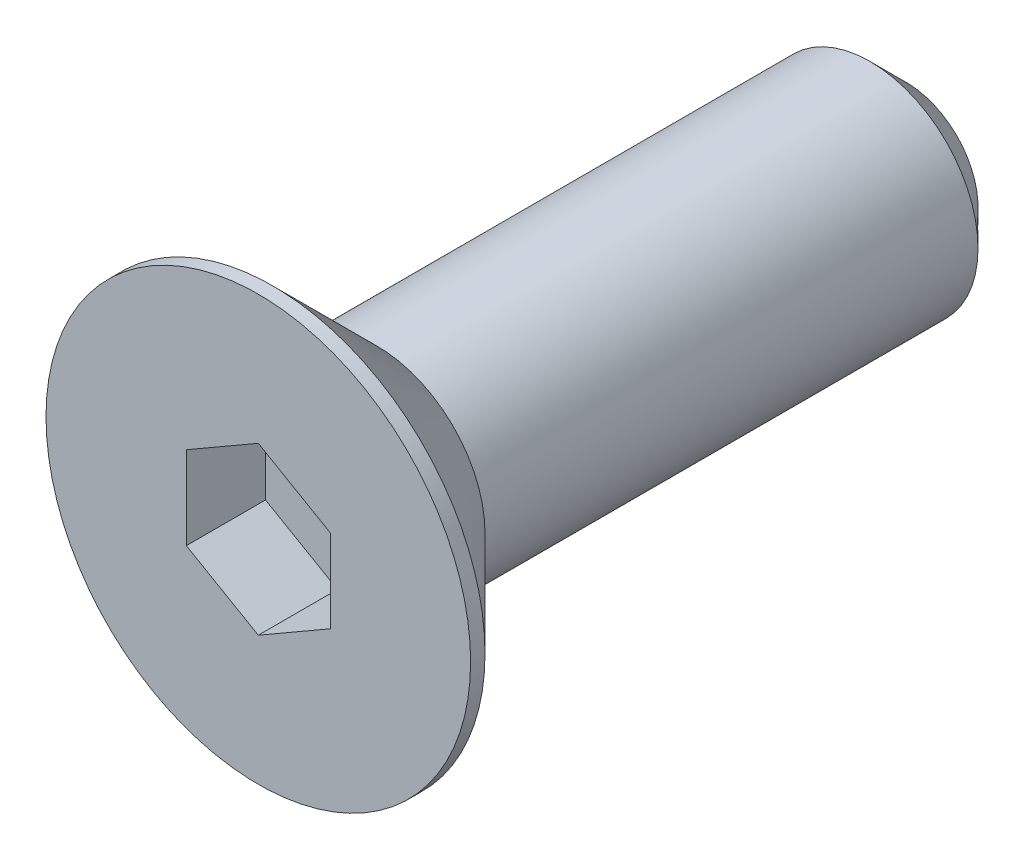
ISO-10303-21;
HEADER;
FILE_DESCRIPTION(('STEP AP214'),'2;1');
FILE_NAME('part.step','',(''),(''),'','','');
FILE_SCHEMA(('AUTOMOTIVE_DESIGN { 1 0 10303 214 1 1 1 1 }'));
ENDSEC;
DATA;
#1=APPLICATION_CONTEXT('core data for automotive mechanical design processes');
#2=APPLICATION_PROTOCOL_DEFINITION('international standard','automotive_design',2000,#1);
#3=PRODUCT_CONTEXT('',#1,'mechanical');
#4=PRODUCT('Part','Part','',(#3));
#5=PRODUCT_RELATED_PRODUCT_CATEGORY('part','',(#4));
#6=PRODUCT_DEFINITION_FORMATION('','',#4);
#7=PRODUCT_DEFINITION_CONTEXT('part definition',#1,'design');
#8=PRODUCT_DEFINITION('design','',#6,#7);
#9=PRODUCT_DEFINITION_SHAPE('','',#8);
#10=(LENGTH_UNIT() NAMED_UNIT(*) SI_UNIT(.MILLI.,.METRE.));
#11=(NAMED_UNIT(*) PLANE_ANGLE_UNIT() SI_UNIT($,.RADIAN.));
#12=(NAMED_UNIT(*) SI_UNIT($,.STERADIAN.) SOLID_ANGLE_UNIT());
#13=UNCERTAINTY_MEASURE_WITH_UNIT(LENGTH_MEASURE(1.E-05),#10,'distance_accuracy_value','');
#14=(GEOMETRIC_REPRESENTATION_CONTEXT(3) GLOBAL_UNCERTAINTY_ASSIGNED_CONTEXT((#13)) GLOBAL_UNIT_ASSIGNED_CONTEXT((#10,
#11,#12)) REPRESENTATION_CONTEXT('',''));
#15=CARTESIAN_POINT('',(0.,0.,0.));
#16=DIRECTION('',(0.,0.,1.));
#17=DIRECTION('',(1.,0.,0.));
#18=AXIS2_PLACEMENT_3D('',#15,#16,#17);
#19=CARTESIAN_POINT('',(0.,0.,0.));
#20=DIRECTION('',(0.,0.,1.));
#21=DIRECTION('',(1.,0.,0.));
#22=AXIS2_PLACEMENT_3D('',#19,#20,#21);
#23=PLANE('',#22);
#24=DIRECTION('',(-0.866025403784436,0.5,0.));
#25=VECTOR('',#24,1.);
#26=CARTESIAN_POINT('',(2.,1.15470053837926,0.));
#27=LINE('',#26,#25);
#28=CARTESIAN_POINT('',(2.,1.15470053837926,0.));
#29=VERTEX_POINT('',#28);
#30=CARTESIAN_POINT('',(0.,2.30940107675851,0.));
#31=VERTEX_POINT('',#30);
#32=EDGE_CURVE('E29',#29,#31,#27,.T.);
#33=ORIENTED_EDGE('',*,*,#32,.F.);
#34=DIRECTION('',(0.,1.,0.));
#35=VECTOR('',#34,1.);
#36=CARTESIAN_POINT('',(2.,-1.15470053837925,0.));
#37=LINE('',#36,#35);
#38=CARTESIAN_POINT('',(2.,-1.15470053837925,0.));
#39=VERTEX_POINT('',#38);
#40=EDGE_CURVE('E112',#39,#29,#37,.T.);
#41=ORIENTED_EDGE('',*,*,#40,.F.);
#42=DIRECTION('',(0.866025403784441,0.5,0.));
#43=VECTOR('',#42,1.);
#44=CARTESIAN_POINT('',(0.,-2.30940107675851,0.));
#45=LINE('',#44,#43);
#46=CARTESIAN_POINT('',(0.,-2.30940107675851,0.));
#47=VERTEX_POINT('',#46);
#48=EDGE_CURVE('E110',#47,#39,#45,.T.);
#49=ORIENTED_EDGE('',*,*,#48,.F.);
#50=DIRECTION('',(0.866025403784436,-0.5,0.));
#51=VECTOR('',#50,1.);
#52=CARTESIAN_POINT('',(-2.,-1.15470053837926,0.));
#53=LINE('',#52,#51);
#54=CARTESIAN_POINT('',(-2.,-1.15470053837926,0.));
#55=VERTEX_POINT('',#54);
#56=EDGE_CURVE('E77',#55,#47,#53,.T.);
#57=ORIENTED_EDGE('',*,*,#56,.F.);
#58=DIRECTION('',(0.,-1.,0.));
#59=VECTOR('',#58,1.);
#60=CARTESIAN_POINT('',(-2.,1.15470053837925,0.));
#61=LINE('',#60,#59);
#62=CARTESIAN_POINT('',(-2.,1.15470053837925,0.));
#63=VERTEX_POINT('',#62);
#64=EDGE_CURVE('E106',#63,#55,#61,.T.);
#65=ORIENTED_EDGE('',*,*,#64,.F.);
#66=DIRECTION('',(-0.866025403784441,-0.5,0.));
#67=VECTOR('',#66,1.);
#68=CARTESIAN_POINT('',(0.,2.30940107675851,0.));
#69=LINE('',#68,#67);
#70=EDGE_CURVE('E103',#31,#63,#69,.T.);
#71=ORIENTED_EDGE('',*,*,#70,.F.);
#72=EDGE_LOOP('',(#33,#41,#49,#57,#65,#71));
#73=FACE_BOUND('',#72,.T.);
#74=CARTESIAN_POINT('',(0.,0.,0.));
#75=DIRECTION('',(0.,0.,1.));
#76=DIRECTION('',(1.,0.,0.));
#77=AXIS2_PLACEMENT_3D('',#74,#75,#76);
#78=CIRCLE('',#77,5.9);
#79=CARTESIAN_POINT('',(5.9,0.,0.));
#80=VERTEX_POINT('',#79);
#81=EDGE_CURVE('E127',#80,#80,#78,.T.);
#82=ORIENTED_EDGE('',*,*,#81,.T.);
#83=EDGE_LOOP('',(#82));
#84=FACE_BOUND('',#83,.T.);
#85=ADVANCED_FACE('F14',(#73,#84),#23,.T.);
#86=CARTESIAN_POINT('',(0.,0.,0.));
#87=DIRECTION('',(0.,0.,1.));
#88=DIRECTION('',(1.,0.,0.));
#89=AXIS2_PLACEMENT_3D('',#86,#87,#88);
#90=CYLINDRICAL_SURFACE('',#89,5.9);
#91=CARTESIAN_POINT('',(0.,0.,-0.39999999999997));
#92=DIRECTION('',(0.,0.,1.));
#93=DIRECTION('',(1.,0.,0.));
#94=AXIS2_PLACEMENT_3D('',#91,#92,#93);
#95=CIRCLE('',#94,5.9);
#96=CARTESIAN_POINT('',(5.9,0.,-0.399999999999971));
#97=VERTEX_POINT('',#96);
#98=EDGE_CURVE('E124',#97,#97,#95,.T.);
#99=ORIENTED_EDGE('',*,*,#98,.T.);
#100=EDGE_LOOP('',(#99));
#101=FACE_BOUND('',#100,.T.);
#102=ORIENTED_EDGE('',*,*,#81,.F.);
#103=EDGE_LOOP('',(#102));
#104=FACE_BOUND('',#103,.T.);
#105=ADVANCED_FACE('F151',(#101,#104),#90,.T.);
#106=CARTESIAN_POINT('',(0.,0.,-0.39999999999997));
#107=DIRECTION('',(0.,0.,1.));
#108=DIRECTION('',(1.,0.,0.));
#109=AXIS2_PLACEMENT_3D('',#106,#107,#108);
#110=CONICAL_SURFACE('',#109,5.9,0.785398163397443);
#111=CARTESIAN_POINT('',(0.,0.,-3.3));
#112=DIRECTION('',(0.,0.,1.));
#113=DIRECTION('',(1.,0.,0.));
#114=AXIS2_PLACEMENT_3D('',#111,#112,#113);
#115=CIRCLE('',#114,3.);
#116=CARTESIAN_POINT('',(3.,0.,-3.3));
#117=VERTEX_POINT('',#116);
#118=EDGE_CURVE('E116',#117,#117,#115,.T.);
#119=ORIENTED_EDGE('',*,*,#118,.T.);
#120=EDGE_LOOP('',(#119));
#121=FACE_BOUND('',#120,.T.);
#122=ORIENTED_EDGE('',*,*,#98,.F.);
#123=EDGE_LOOP('',(#122));
#124=FACE_BOUND('',#123,.T.);
#125=ADVANCED_FACE('F157',(#121,#124),#110,.T.);
#126=CARTESIAN_POINT('',(0.,0.,0.));
#127=DIRECTION('',(0.,0.,1.));
#128=DIRECTION('',(1.,0.,0.));
#129=AXIS2_PLACEMENT_3D('',#126,#127,#128);
#130=CYLINDRICAL_SURFACE('',#129,3.);
#131=CARTESIAN_POINT('',(0.,0.,-17.));
#132=DIRECTION('',(0.,0.,-1.));
#133=DIRECTION('',(-1.,0.,0.));
#134=AXIS2_PLACEMENT_3D('',#131,#132,#133);
#135=CIRCLE('',#134,3.);
#136=CARTESIAN_POINT('',(-3.,0.,-17.));
#137=VERTEX_POINT('',#136);
#138=EDGE_CURVE('E22',#137,#137,#135,.F.);
#139=ORIENTED_EDGE('',*,*,#138,.T.);
#140=EDGE_LOOP('',(#139));
#141=FACE_BOUND('',#140,.T.);
#142=ORIENTED_EDGE('',*,*,#118,.F.);
#143=EDGE_LOOP('',(#142));
#144=FACE_BOUND('',#143,.T.);
#145=ADVANCED_FACE('F132',(#141,#144),#130,.T.);
#146=CARTESIAN_POINT('',(3.,0.,-18.));
#147=DIRECTION('',(0.,0.,-1.));
#148=DIRECTION('',(-1.,0.,0.));
#149=AXIS2_PLACEMENT_3D('',#146,#147,#148);
#150=PLANE('',#149);
#151=CARTESIAN_POINT('',(0.,0.,-18.));
#152=DIRECTION('',(0.,0.,-1.));
#153=DIRECTION('',(-1.,0.,0.));
#154=AXIS2_PLACEMENT_3D('',#151,#152,#153);
#155=CIRCLE('',#154,2.);
#156=CARTESIAN_POINT('',(-2.,0.,-18.));
#157=VERTEX_POINT('',#156);
#158=EDGE_CURVE('E9',#157,#157,#155,.T.);
#159=ORIENTED_EDGE('',*,*,#158,.T.);
#160=EDGE_LOOP('',(#159));
#161=FACE_BOUND('',#160,.T.);
#162=ADVANCED_FACE('F137',(#161),#150,.T.);
#163=CARTESIAN_POINT('',(0.,0.,-17.));
#164=DIRECTION('',(0.,0.,1.));
#165=DIRECTION('',(1.,0.,0.));
#166=AXIS2_PLACEMENT_3D('',#163,#164,#165);
#167=CONICAL_SURFACE('',#166,3.,0.785398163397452);
#168=ORIENTED_EDGE('',*,*,#158,.F.);
#169=EDGE_LOOP('',(#168));
#170=FACE_BOUND('',#169,.T.);
#171=ORIENTED_EDGE('',*,*,#138,.F.);
#172=EDGE_LOOP('',(#171));
#173=FACE_BOUND('',#172,.T.);
#174=ADVANCED_FACE('F16',(#170,#173),#167,.T.);
#175=CARTESIAN_POINT('',(2.,1.15470053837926,-2.2));
#176=DIRECTION('',(0.5,0.866025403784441,0.));
#177=DIRECTION('',(-0.866025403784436,0.5,0.));
#178=AXIS2_PLACEMENT_3D('',#175,#176,#177);
#179=PLANE('',#178);
#180=ORIENTED_EDGE('',*,*,#32,.T.);
#181=DIRECTION('',(0.,0.,1.));
#182=VECTOR('',#181,1.);
#183=CARTESIAN_POINT('',(0.,2.30940107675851,-2.2));
#184=LINE('',#183,#182);
#185=CARTESIAN_POINT('',(0.,2.30940107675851,-2.2));
#186=VERTEX_POINT('',#185);
#187=EDGE_CURVE('E59',#186,#31,#184,.T.);
#188=ORIENTED_EDGE('',*,*,#187,.F.);
#189=DIRECTION('',(-0.866025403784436,0.5,0.));
#190=VECTOR('',#189,1.);
#191=CARTESIAN_POINT('',(2.,1.15470053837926,-2.2));
#192=LINE('',#191,#190);
#193=CARTESIAN_POINT('',(2.,1.15470053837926,-2.2));
#194=VERTEX_POINT('',#193);
#195=EDGE_CURVE('E114',#194,#186,#192,.T.);
#196=ORIENTED_EDGE('',*,*,#195,.F.);
#197=DIRECTION('',(0.,0.,1.));
#198=VECTOR('',#197,1.);
#199=CARTESIAN_POINT('',(2.,1.15470053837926,-2.2));
#200=LINE('',#199,#198);
#201=EDGE_CURVE('E37',#194,#29,#200,.T.);
#202=ORIENTED_EDGE('',*,*,#201,.T.);
#203=EDGE_LOOP('',(#180,#188,#196,#202));
#204=FACE_BOUND('',#203,.T.);
#205=ADVANCED_FACE('F136',(#204),#179,.F.);
#206=CARTESIAN_POINT('',(2.,-1.15470053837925,-2.2));
#207=DIRECTION('',(1.,0.,0.));
#208=DIRECTION('',(0.,0.,-1.));
#209=AXIS2_PLACEMENT_3D('',#206,#207,#208);
#210=PLANE('',#209);
#211=ORIENTED_EDGE('',*,*,#40,.T.);
#212=ORIENTED_EDGE('',*,*,#201,.F.);
#213=DIRECTION('',(0.,1.,0.));
#214=VECTOR('',#213,1.);
#215=CARTESIAN_POINT('',(2.,-1.15470053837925,-2.2));
#216=LINE('',#215,#214);
#217=CARTESIAN_POINT('',(2.,-1.15470053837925,-2.2));
#218=VERTEX_POINT('',#217);
#219=EDGE_CURVE('E89',#218,#194,#216,.T.);
#220=ORIENTED_EDGE('',*,*,#219,.F.);
#221=DIRECTION('',(0.,0.,1.));
#222=VECTOR('',#221,1.);
#223=CARTESIAN_POINT('',(2.,-1.15470053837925,-2.2));
#224=LINE('',#223,#222);
#225=EDGE_CURVE('E81',#218,#39,#224,.T.);
#226=ORIENTED_EDGE('',*,*,#225,.T.);
#227=EDGE_LOOP('',(#211,#212,#220,#226));
#228=FACE_BOUND('',#227,.T.);
#229=ADVANCED_FACE('F145',(#228),#210,.F.);
#230=CARTESIAN_POINT('',(0.,-2.30940107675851,-2.2));
#231=DIRECTION('',(0.5,-0.866025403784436,0.));
#232=DIRECTION('',(0.866025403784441,0.5,0.));
#233=AXIS2_PLACEMENT_3D('',#230,#231,#232);
#234=PLANE('',#233);
#235=ORIENTED_EDGE('',*,*,#48,.T.);
#236=ORIENTED_EDGE('',*,*,#225,.F.);
#237=DIRECTION('',(0.866025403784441,0.5,0.));
#238=VECTOR('',#237,1.);
#239=CARTESIAN_POINT('',(0.,-2.30940107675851,-2.2));
#240=LINE('',#239,#238);
#241=CARTESIAN_POINT('',(0.,-2.30940107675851,-2.2));
#242=VERTEX_POINT('',#241);
#243=EDGE_CURVE('E85',#242,#218,#240,.T.);
#244=ORIENTED_EDGE('',*,*,#243,.F.);
#245=DIRECTION('',(0.,0.,1.));
#246=VECTOR('',#245,1.);
#247=CARTESIAN_POINT('',(0.,-2.30940107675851,-2.2));
#248=LINE('',#247,#246);
#249=EDGE_CURVE('E70',#242,#47,#248,.T.);
#250=ORIENTED_EDGE('',*,*,#249,.T.);
#251=EDGE_LOOP('',(#235,#236,#244,#250));
#252=FACE_BOUND('',#251,.T.);
#253=ADVANCED_FACE('F86',(#252),#234,.F.);
#254=CARTESIAN_POINT('',(-2.,-1.15470053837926,-2.2));
#255=DIRECTION('',(-0.5,-0.866025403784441,0.));
#256=DIRECTION('',(0.866025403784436,-0.5,0.));
#257=AXIS2_PLACEMENT_3D('',#254,#255,#256);
#258=PLANE('',#257);
#259=ORIENTED_EDGE('',*,*,#56,.T.);
#260=ORIENTED_EDGE('',*,*,#249,.F.);
#261=DIRECTION('',(0.866025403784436,-0.5,0.));
#262=VECTOR('',#261,1.);
#263=CARTESIAN_POINT('',(-2.,-1.15470053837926,-2.2));
#264=LINE('',#263,#262);
#265=CARTESIAN_POINT('',(-2.,-1.15470053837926,-2.2));
#266=VERTEX_POINT('',#265);
#267=EDGE_CURVE('E74',#266,#242,#264,.T.);
#268=ORIENTED_EDGE('',*,*,#267,.F.);
#269=DIRECTION('',(0.,0.,1.));
#270=VECTOR('',#269,1.);
#271=CARTESIAN_POINT('',(-2.,-1.15470053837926,-2.2));
#272=LINE('',#271,#270);
#273=EDGE_CURVE('E82',#266,#55,#272,.T.);
#274=ORIENTED_EDGE('',*,*,#273,.T.);
#275=EDGE_LOOP('',(#259,#260,#268,#274));
#276=FACE_BOUND('',#275,.T.);
#277=ADVANCED_FACE('F72',(#276),#258,.F.);
#278=CARTESIAN_POINT('',(-2.,1.15470053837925,-2.2));
#279=DIRECTION('',(-1.,0.,0.));
#280=DIRECTION('',(0.,0.,1.));
#281=AXIS2_PLACEMENT_3D('',#278,#279,#280);
#282=PLANE('',#281);
#283=ORIENTED_EDGE('',*,*,#64,.T.);
#284=ORIENTED_EDGE('',*,*,#273,.F.);
#285=DIRECTION('',(0.,-1.,0.));
#286=VECTOR('',#285,1.);
#287=CARTESIAN_POINT('',(-2.,1.15470053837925,-2.2));
#288=LINE('',#287,#286);
#289=CARTESIAN_POINT('',(-2.,1.15470053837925,-2.2));
#290=VERTEX_POINT('',#289);
#291=EDGE_CURVE('E95',#290,#266,#288,.T.);
#292=ORIENTED_EDGE('',*,*,#291,.F.);
#293=DIRECTION('',(0.,0.,1.));
#294=VECTOR('',#293,1.);
#295=CARTESIAN_POINT('',(-2.,1.15470053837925,-2.2));
#296=LINE('',#295,#294);
#297=EDGE_CURVE('E119',#290,#63,#296,.T.);
#298=ORIENTED_EDGE('',*,*,#297,.T.);
#299=EDGE_LOOP('',(#283,#284,#292,#298));
#300=FACE_BOUND('',#299,.T.);
#301=ADVANCED_FACE('F170',(#300),#282,.F.);
#302=CARTESIAN_POINT('',(0.,2.30940107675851,-2.2));
#303=DIRECTION('',(-0.5,0.866025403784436,0.));
#304=DIRECTION('',(-0.866025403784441,-0.5,0.));
#305=AXIS2_PLACEMENT_3D('',#302,#303,#304);
#306=PLANE('',#305);
#307=ORIENTED_EDGE('',*,*,#70,.T.);
#308=ORIENTED_EDGE('',*,*,#297,.F.);
#309=DIRECTION('',(-0.866025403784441,-0.5,0.));
#310=VECTOR('',#309,1.);
#311=CARTESIAN_POINT('',(0.,2.30940107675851,-2.2));
#312=LINE('',#311,#310);
#313=EDGE_CURVE('E97',#186,#290,#312,.T.);
#314=ORIENTED_EDGE('',*,*,#313,.F.);
#315=ORIENTED_EDGE('',*,*,#187,.T.);
#316=EDGE_LOOP('',(#307,#308,#314,#315));
#317=FACE_BOUND('',#316,.T.);
#318=ADVANCED_FACE('F167',(#317),#306,.F.);
#319=CARTESIAN_POINT('',(0.,2.30940107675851,-2.2));
#320=DIRECTION('',(0.,0.,1.));
#321=DIRECTION('',(1.,0.,0.));
#322=AXIS2_PLACEMENT_3D('',#319,#320,#321);
#323=PLANE('',#322);
#324=ORIENTED_EDGE('',*,*,#195,.T.);
#325=ORIENTED_EDGE('',*,*,#313,.T.);
#326=ORIENTED_EDGE('',*,*,#291,.T.);
#327=ORIENTED_EDGE('',*,*,#267,.T.);
#328=ORIENTED_EDGE('',*,*,#243,.T.);
#329=ORIENTED_EDGE('',*,*,#219,.T.);
#330=EDGE_LOOP('',(#324,#325,#326,#327,#328,#329));
#331=FACE_BOUND('',#330,.T.);
#332=ADVANCED_FACE('F92',(#331),#323,.T.);
#333=CLOSED_SHELL('',(#85,#105,#125,#145,#162,#174,#205,#229,#253,#277,#301,#318,#332));
#334=MANIFOLD_SOLID_BREP('B1',#333);
#335=ADVANCED_BREP_SHAPE_REPRESENTATION('',(#18,#334),#14);
#336=SHAPE_DEFINITION_REPRESENTATION(#9,#335);
ENDSEC;
END-ISO-10303-21;
